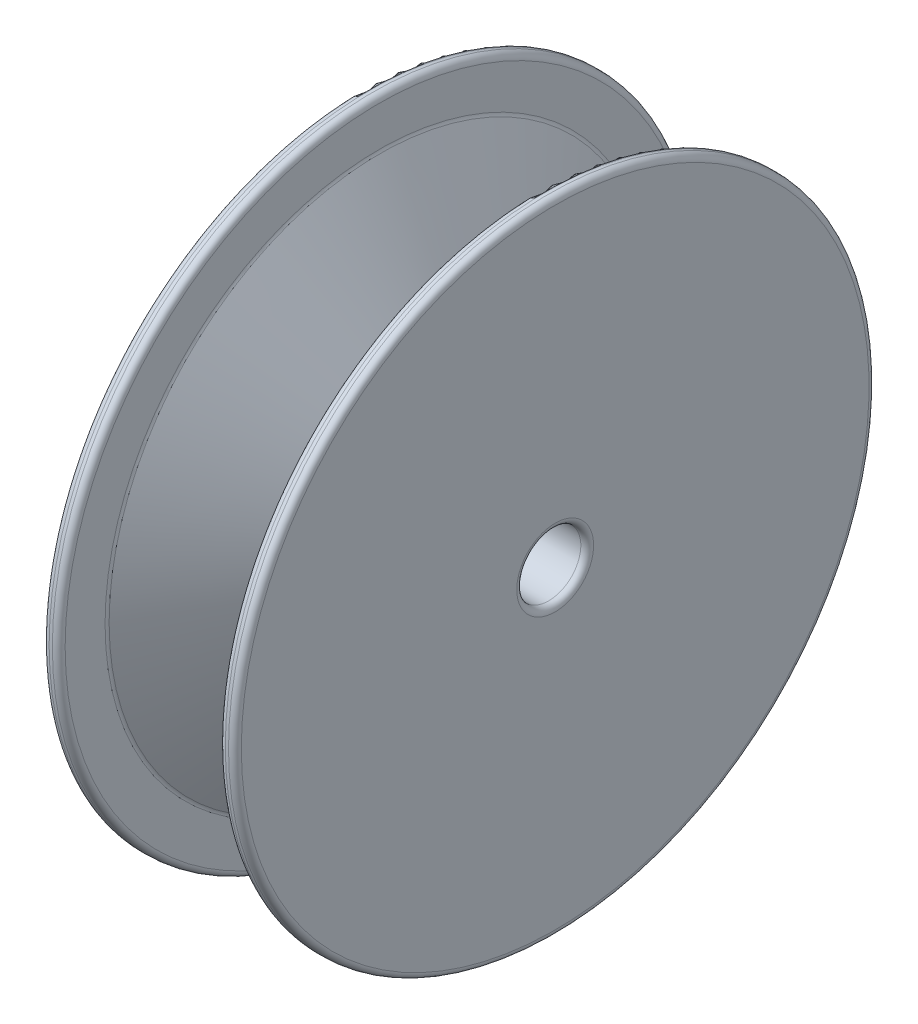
ISO-10303-21;
HEADER;
FILE_DESCRIPTION(('STEP AP214'),'2;1');
FILE_NAME('part.step','',(''),(''),'','','');
FILE_SCHEMA(('AUTOMOTIVE_DESIGN { 1 0 10303 214 1 1 1 1 }'));
ENDSEC;
DATA;
#1=APPLICATION_CONTEXT('core data for automotive mechanical design processes');
#2=APPLICATION_PROTOCOL_DEFINITION('international standard','automotive_design',2000,#1);
#3=PRODUCT_CONTEXT('',#1,'mechanical');
#4=PRODUCT('Part','Part','',(#3));
#5=PRODUCT_RELATED_PRODUCT_CATEGORY('part','',(#4));
#6=PRODUCT_DEFINITION_FORMATION('','',#4);
#7=PRODUCT_DEFINITION_CONTEXT('part definition',#1,'design');
#8=PRODUCT_DEFINITION('design','',#6,#7);
#9=PRODUCT_DEFINITION_SHAPE('','',#8);
#10=(LENGTH_UNIT() NAMED_UNIT(*) SI_UNIT(.MILLI.,.METRE.));
#11=(NAMED_UNIT(*) PLANE_ANGLE_UNIT() SI_UNIT($,.RADIAN.));
#12=(NAMED_UNIT(*) SI_UNIT($,.STERADIAN.) SOLID_ANGLE_UNIT());
#13=UNCERTAINTY_MEASURE_WITH_UNIT(LENGTH_MEASURE(1.E-05),#10,'distance_accuracy_value','');
#14=(GEOMETRIC_REPRESENTATION_CONTEXT(3) GLOBAL_UNCERTAINTY_ASSIGNED_CONTEXT((#13)) GLOBAL_UNIT_ASSIGNED_CONTEXT((#10,
#11,#12)) REPRESENTATION_CONTEXT('',''));
#15=CARTESIAN_POINT('',(0.,0.,0.));
#16=DIRECTION('',(0.,0.,1.));
#17=DIRECTION('',(1.,0.,0.));
#18=AXIS2_PLACEMENT_3D('',#15,#16,#17);
#19=CARTESIAN_POINT('',(0.,0.,0.));
#20=DIRECTION('',(-1.,0.,0.));
#21=DIRECTION('',(0.,0.,1.));
#22=AXIS2_PLACEMENT_3D('',#19,#20,#21);
#23=CYLINDRICAL_SURFACE('',#22,1.);
#24=CARTESIAN_POINT('',(2.8,0.,0.));
#25=DIRECTION('',(-1.,0.,0.));
#26=DIRECTION('',(0.,0.,1.));
#27=AXIS2_PLACEMENT_3D('',#24,#25,#26);
#28=CIRCLE('',#27,1.);
#29=CARTESIAN_POINT('',(2.8,0.,1.));
#30=VERTEX_POINT('',#29);
#31=EDGE_CURVE('E40',#30,#30,#28,.F.);
#32=ORIENTED_EDGE('',*,*,#31,.T.);
#33=EDGE_LOOP('',(#32));
#34=FACE_BOUND('',#33,.T.);
#35=CARTESIAN_POINT('',(-2.8,0.,0.));
#36=DIRECTION('',(1.,0.,0.));
#37=DIRECTION('',(0.,0.,-1.));
#38=AXIS2_PLACEMENT_3D('',#35,#36,#37);
#39=CIRCLE('',#38,1.);
#40=CARTESIAN_POINT('',(-2.8,0.,-1.));
#41=VERTEX_POINT('',#40);
#42=EDGE_CURVE('E44',#41,#41,#39,.F.);
#43=ORIENTED_EDGE('',*,*,#42,.T.);
#44=EDGE_LOOP('',(#43));
#45=FACE_BOUND('',#44,.T.);
#46=ADVANCED_FACE('F29',(#34,#45),#23,.F.);
#47=CARTESIAN_POINT('',(3.,1.,0.));
#48=DIRECTION('',(-1.,0.,0.));
#49=DIRECTION('',(0.,0.,1.));
#50=AXIS2_PLACEMENT_3D('',#47,#48,#49);
#51=PLANE('',#50);
#52=CARTESIAN_POINT('',(3.,0.,0.));
#53=DIRECTION('',(-1.,0.,0.));
#54=DIRECTION('',(0.,0.,1.));
#55=AXIS2_PLACEMENT_3D('',#52,#53,#54);
#56=CIRCLE('',#55,1.2);
#57=CARTESIAN_POINT('',(3.,0.,1.2));
#58=VERTEX_POINT('',#57);
#59=EDGE_CURVE('E49',#58,#58,#56,.T.);
#60=ORIENTED_EDGE('',*,*,#59,.T.);
#61=EDGE_LOOP('',(#60));
#62=FACE_BOUND('',#61,.T.);
#63=CARTESIAN_POINT('',(3.,0.,0.));
#64=DIRECTION('',(-1.,0.,0.));
#65=DIRECTION('',(0.,0.,1.));
#66=AXIS2_PLACEMENT_3D('',#63,#64,#65);
#67=CIRCLE('',#66,9.8);
#68=CARTESIAN_POINT('',(3.,0.,9.8));
#69=VERTEX_POINT('',#68);
#70=EDGE_CURVE('E52',#69,#69,#67,.F.);
#71=ORIENTED_EDGE('',*,*,#70,.T.);
#72=EDGE_LOOP('',(#71));
#73=FACE_BOUND('',#72,.T.);
#74=ADVANCED_FACE('F135',(#62,#73),#51,.F.);
#75=CARTESIAN_POINT('',(0.,0.,0.));
#76=DIRECTION('',(-1.,0.,0.));
#77=DIRECTION('',(0.,0.,1.));
#78=AXIS2_PLACEMENT_3D('',#75,#76,#77);
#79=CYLINDRICAL_SURFACE('',#78,10.);
#80=CARTESIAN_POINT('',(2.69999999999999,0.,0.));
#81=DIRECTION('',(1.,0.,0.));
#82=DIRECTION('',(0.,0.,-1.));
#83=AXIS2_PLACEMENT_3D('',#80,#81,#82);
#84=CIRCLE('',#83,10.);
#85=CARTESIAN_POINT('',(2.69999999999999,0.,-10.));
#86=VERTEX_POINT('',#85);
#87=EDGE_CURVE('E79',#86,#86,#84,.T.);
#88=ORIENTED_EDGE('',*,*,#87,.T.);
#89=EDGE_LOOP('',(#88));
#90=FACE_BOUND('',#89,.T.);
#91=CARTESIAN_POINT('',(2.8,0.,0.));
#92=DIRECTION('',(-1.,0.,0.));
#93=DIRECTION('',(0.,0.,1.));
#94=AXIS2_PLACEMENT_3D('',#91,#92,#93);
#95=CIRCLE('',#94,10.);
#96=CARTESIAN_POINT('',(2.8,0.,10.));
#97=VERTEX_POINT('',#96);
#98=EDGE_CURVE('E82',#97,#97,#95,.T.);
#99=ORIENTED_EDGE('',*,*,#98,.T.);
#100=EDGE_LOOP('',(#99));
#101=FACE_BOUND('',#100,.T.);
#102=ADVANCED_FACE('F141',(#90,#101),#79,.T.);
#103=CARTESIAN_POINT('',(2.49999999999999,8.5,0.));
#104=DIRECTION('',(1.,0.,0.));
#105=DIRECTION('',(0.,0.,-1.));
#106=AXIS2_PLACEMENT_3D('',#103,#104,#105);
#107=PLANE('',#106);
#108=CARTESIAN_POINT('',(2.49999999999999,0.,0.));
#109=DIRECTION('',(1.,0.,0.));
#110=DIRECTION('',(0.,0.,-1.));
#111=AXIS2_PLACEMENT_3D('',#108,#109,#110);
#112=CIRCLE('',#111,9.8);
#113=CARTESIAN_POINT('',(2.49999999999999,0.,-9.8));
#114=VERTEX_POINT('',#113);
#115=EDGE_CURVE('E85',#114,#114,#112,.F.);
#116=ORIENTED_EDGE('',*,*,#115,.T.);
#117=EDGE_LOOP('',(#116));
#118=FACE_BOUND('',#117,.T.);
#119=CARTESIAN_POINT('',(2.49999999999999,0.,0.));
#120=DIRECTION('',(1.,0.,0.));
#121=DIRECTION('',(0.,0.,-1.));
#122=AXIS2_PLACEMENT_3D('',#119,#120,#121);
#123=CIRCLE('',#122,8.5535898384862);
#124=CARTESIAN_POINT('',(2.49999999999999,0.,-8.5535898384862));
#125=VERTEX_POINT('',#124);
#126=EDGE_CURVE('E88',#125,#125,#123,.T.);
#127=ORIENTED_EDGE('',*,*,#126,.T.);
#128=EDGE_LOOP('',(#127));
#129=FACE_BOUND('',#128,.T.);
#130=ADVANCED_FACE('F197',(#118,#129),#107,.F.);
#131=CARTESIAN_POINT('',(2.5,0.,0.));
#132=DIRECTION('',(1.,0.,0.));
#133=DIRECTION('',(0.,0.,-1.));
#134=AXIS2_PLACEMENT_3D('',#131,#132,#133);
#135=CONICAL_SURFACE('',#134,8.5,1.04719755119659);
#136=CARTESIAN_POINT('',(2.47320508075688,0.,0.));
#137=DIRECTION('',(1.,0.,0.));
#138=DIRECTION('',(0.,0.,-1.));
#139=AXIS2_PLACEMENT_3D('',#136,#137,#138);
#140=CIRCLE('',#139,8.4535898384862);
#141=CARTESIAN_POINT('',(2.47320508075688,0.,-8.4535898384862));
#142=VERTEX_POINT('',#141);
#143=EDGE_CURVE('E73',#142,#142,#140,.F.);
#144=ORIENTED_EDGE('',*,*,#143,.T.);
#145=EDGE_LOOP('',(#144));
#146=FACE_BOUND('',#145,.T.);
#147=CARTESIAN_POINT('',(0.173205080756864,0.,0.));
#148=DIRECTION('',(1.,0.,0.));
#149=DIRECTION('',(0.,0.,-1.));
#150=AXIS2_PLACEMENT_3D('',#147,#148,#149);
#151=CIRCLE('',#150,4.46987298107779);
#152=CARTESIAN_POINT('',(0.173205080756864,0.,-4.46987298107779));
#153=VERTEX_POINT('',#152);
#154=EDGE_CURVE('E76',#153,#153,#151,.T.);
#155=ORIENTED_EDGE('',*,*,#154,.T.);
#156=EDGE_LOOP('',(#155));
#157=FACE_BOUND('',#156,.T.);
#158=ADVANCED_FACE('F193',(#146,#157),#135,.T.);
#159=CARTESIAN_POINT('',(0.,0.,0.));
#160=DIRECTION('',(-1.,0.,0.));
#161=DIRECTION('',(0.,0.,1.));
#162=AXIS2_PLACEMENT_3D('',#159,#160,#161);
#163=CONICAL_SURFACE('',#162,4.16987298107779,1.0471975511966);
#164=CARTESIAN_POINT('',(-0.173205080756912,0.,0.));
#165=DIRECTION('',(-1.,0.,0.));
#166=DIRECTION('',(0.,0.,1.));
#167=AXIS2_PLACEMENT_3D('',#164,#165,#166);
#168=CIRCLE('',#167,4.46987298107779);
#169=CARTESIAN_POINT('',(-0.173205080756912,0.,4.46987298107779));
#170=VERTEX_POINT('',#169);
#171=EDGE_CURVE('E67',#170,#170,#168,.T.);
#172=ORIENTED_EDGE('',*,*,#171,.T.);
#173=EDGE_LOOP('',(#172));
#174=FACE_BOUND('',#173,.T.);
#175=CARTESIAN_POINT('',(-2.47320508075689,0.,0.));
#176=DIRECTION('',(-1.,0.,0.));
#177=DIRECTION('',(0.,0.,1.));
#178=AXIS2_PLACEMENT_3D('',#175,#176,#177);
#179=CIRCLE('',#178,8.45358983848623);
#180=CARTESIAN_POINT('',(-2.47320508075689,0.,8.45358983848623));
#181=VERTEX_POINT('',#180);
#182=EDGE_CURVE('E70',#181,#181,#179,.F.);
#183=ORIENTED_EDGE('',*,*,#182,.T.);
#184=EDGE_LOOP('',(#183));
#185=FACE_BOUND('',#184,.T.);
#186=ADVANCED_FACE('F187',(#174,#185),#163,.T.);
#187=CARTESIAN_POINT('',(-2.5,10.,0.));
#188=DIRECTION('',(-1.,0.,0.));
#189=DIRECTION('',(0.,0.,1.));
#190=AXIS2_PLACEMENT_3D('',#187,#188,#189);
#191=PLANE('',#190);
#192=CARTESIAN_POINT('',(-2.5,0.,0.));
#193=DIRECTION('',(-1.,0.,0.));
#194=DIRECTION('',(0.,0.,1.));
#195=AXIS2_PLACEMENT_3D('',#192,#193,#194);
#196=CIRCLE('',#195,8.55358983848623);
#197=CARTESIAN_POINT('',(-2.5,0.,8.55358983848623));
#198=VERTEX_POINT('',#197);
#199=EDGE_CURVE('E61',#198,#198,#196,.T.);
#200=ORIENTED_EDGE('',*,*,#199,.T.);
#201=EDGE_LOOP('',(#200));
#202=FACE_BOUND('',#201,.T.);
#203=CARTESIAN_POINT('',(-2.5,0.,0.));
#204=DIRECTION('',(-1.,0.,0.));
#205=DIRECTION('',(0.,0.,1.));
#206=AXIS2_PLACEMENT_3D('',#203,#204,#205);
#207=CIRCLE('',#206,9.8);
#208=CARTESIAN_POINT('',(-2.5,0.,9.8));
#209=VERTEX_POINT('',#208);
#210=EDGE_CURVE('E64',#209,#209,#207,.F.);
#211=ORIENTED_EDGE('',*,*,#210,.T.);
#212=EDGE_LOOP('',(#211));
#213=FACE_BOUND('',#212,.T.);
#214=ADVANCED_FACE('F181',(#202,#213),#191,.F.);
#215=CARTESIAN_POINT('',(0.,0.,0.));
#216=DIRECTION('',(-1.,0.,0.));
#217=DIRECTION('',(0.,0.,1.));
#218=AXIS2_PLACEMENT_3D('',#215,#216,#217);
#219=CYLINDRICAL_SURFACE('',#218,10.);
#220=CARTESIAN_POINT('',(-2.7,0.,0.));
#221=DIRECTION('',(-1.,0.,0.));
#222=DIRECTION('',(0.,0.,1.));
#223=AXIS2_PLACEMENT_3D('',#220,#221,#222);
#224=CIRCLE('',#223,10.);
#225=CARTESIAN_POINT('',(-2.7,0.,10.));
#226=VERTEX_POINT('',#225);
#227=EDGE_CURVE('E55',#226,#226,#224,.T.);
#228=ORIENTED_EDGE('',*,*,#227,.T.);
#229=EDGE_LOOP('',(#228));
#230=FACE_BOUND('',#229,.T.);
#231=CARTESIAN_POINT('',(-2.8,0.,0.));
#232=DIRECTION('',(1.,0.,0.));
#233=DIRECTION('',(0.,0.,-1.));
#234=AXIS2_PLACEMENT_3D('',#231,#232,#233);
#235=CIRCLE('',#234,10.);
#236=CARTESIAN_POINT('',(-2.8,0.,-10.));
#237=VERTEX_POINT('',#236);
#238=EDGE_CURVE('E58',#237,#237,#235,.T.);
#239=ORIENTED_EDGE('',*,*,#238,.T.);
#240=EDGE_LOOP('',(#239));
#241=FACE_BOUND('',#240,.T.);
#242=ADVANCED_FACE('F117',(#230,#241),#219,.T.);
#243=CARTESIAN_POINT('',(-3.,1.,0.));
#244=DIRECTION('',(1.,0.,0.));
#245=DIRECTION('',(0.,0.,-1.));
#246=AXIS2_PLACEMENT_3D('',#243,#244,#245);
#247=PLANE('',#246);
#248=CARTESIAN_POINT('',(-3.,-6.53003817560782,0.));
#249=DIRECTION('',(-1.,0.,0.));
#250=DIRECTION('',(0.,0.,-1.));
#251=AXIS2_PLACEMENT_3D('',#248,#249,#250);
#252=CIRCLE('',#251,0.843426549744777);
#253=CARTESIAN_POINT('',(-3.,-6.53003817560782,-0.843426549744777));
#254=VERTEX_POINT('',#253);
#255=EDGE_CURVE('E98',#254,#254,#252,.T.);
#256=ORIENTED_EDGE('',*,*,#255,.F.);
#257=EDGE_LOOP('',(#256));
#258=FACE_BOUND('',#257,.T.);
#259=CARTESIAN_POINT('',(-3.,6.53003817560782,0.));
#260=DIRECTION('',(-1.,0.,0.));
#261=DIRECTION('',(0.,0.,1.));
#262=AXIS2_PLACEMENT_3D('',#259,#260,#261);
#263=CIRCLE('',#262,0.843426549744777);
#264=CARTESIAN_POINT('',(-3.,6.53003817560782,0.843426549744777));
#265=VERTEX_POINT('',#264);
#266=EDGE_CURVE('E92',#265,#265,#263,.T.);
#267=ORIENTED_EDGE('',*,*,#266,.F.);
#268=EDGE_LOOP('',(#267));
#269=FACE_BOUND('',#268,.T.);
#270=CARTESIAN_POINT('',(-3.,0.,0.));
#271=DIRECTION('',(1.,0.,0.));
#272=DIRECTION('',(0.,0.,-1.));
#273=AXIS2_PLACEMENT_3D('',#270,#271,#272);
#274=CIRCLE('',#273,9.8);
#275=CARTESIAN_POINT('',(-3.,0.,-9.8));
#276=VERTEX_POINT('',#275);
#277=EDGE_CURVE('E10',#276,#276,#274,.F.);
#278=ORIENTED_EDGE('',*,*,#277,.T.);
#279=EDGE_LOOP('',(#278));
#280=FACE_BOUND('',#279,.T.);
#281=CARTESIAN_POINT('',(-3.,0.,0.));
#282=DIRECTION('',(1.,0.,0.));
#283=DIRECTION('',(0.,0.,-1.));
#284=AXIS2_PLACEMENT_3D('',#281,#282,#283);
#285=CIRCLE('',#284,1.2);
#286=CARTESIAN_POINT('',(-3.,0.,-1.2));
#287=VERTEX_POINT('',#286);
#288=EDGE_CURVE('E36',#287,#287,#285,.T.);
#289=ORIENTED_EDGE('',*,*,#288,.T.);
#290=EDGE_LOOP('',(#289));
#291=FACE_BOUND('',#290,.T.);
#292=ADVANCED_FACE('F113',(#258,#269,#280,#291),#247,.F.);
#293=CARTESIAN_POINT('',(2.69999999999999,0.,0.));
#294=DIRECTION('',(1.,0.,0.));
#295=DIRECTION('',(0.,0.,-1.));
#296=AXIS2_PLACEMENT_3D('',#293,#294,#295);
#297=TOROIDAL_SURFACE('',#296,9.8,0.2);
#298=ORIENTED_EDGE('',*,*,#87,.F.);
#299=EDGE_LOOP('',(#298));
#300=FACE_BOUND('',#299,.T.);
#301=ORIENTED_EDGE('',*,*,#115,.F.);
#302=EDGE_LOOP('',(#301));
#303=FACE_BOUND('',#302,.T.);
#304=ADVANCED_FACE('F116',(#300,#303),#297,.T.);
#305=CARTESIAN_POINT('',(2.29999999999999,0.,0.));
#306=DIRECTION('',(1.,0.,0.));
#307=DIRECTION('',(0.,0.,-1.));
#308=AXIS2_PLACEMENT_3D('',#305,#306,#307);
#309=TOROIDAL_SURFACE('',#308,8.5535898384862,0.2);
#310=ORIENTED_EDGE('',*,*,#126,.F.);
#311=EDGE_LOOP('',(#310));
#312=FACE_BOUND('',#311,.T.);
#313=ORIENTED_EDGE('',*,*,#143,.F.);
#314=EDGE_LOOP('',(#313));
#315=FACE_BOUND('',#314,.T.);
#316=ADVANCED_FACE('F149',(#312,#315),#309,.F.);
#317=CARTESIAN_POINT('',(0.,0.,0.));
#318=DIRECTION('',(-1.,0.,0.));
#319=DIRECTION('',(0.,0.,1.));
#320=AXIS2_PLACEMENT_3D('',#317,#318,#319);
#321=TOROIDAL_SURFACE('',#320,4.56987298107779,0.2);
#322=ORIENTED_EDGE('',*,*,#154,.F.);
#323=EDGE_LOOP('',(#322));
#324=FACE_BOUND('',#323,.T.);
#325=ORIENTED_EDGE('',*,*,#171,.F.);
#326=EDGE_LOOP('',(#325));
#327=FACE_BOUND('',#326,.T.);
#328=ADVANCED_FACE('F153',(#324,#327),#321,.F.);
#329=CARTESIAN_POINT('',(-2.3,0.,0.));
#330=DIRECTION('',(-1.,0.,0.));
#331=DIRECTION('',(0.,0.,1.));
#332=AXIS2_PLACEMENT_3D('',#329,#330,#331);
#333=TOROIDAL_SURFACE('',#332,8.55358983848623,0.2);
#334=ORIENTED_EDGE('',*,*,#182,.F.);
#335=EDGE_LOOP('',(#334));
#336=FACE_BOUND('',#335,.T.);
#337=ORIENTED_EDGE('',*,*,#199,.F.);
#338=EDGE_LOOP('',(#337));
#339=FACE_BOUND('',#338,.T.);
#340=ADVANCED_FACE('F157',(#336,#339),#333,.F.);
#341=CARTESIAN_POINT('',(-2.7,0.,0.));
#342=DIRECTION('',(-1.,0.,0.));
#343=DIRECTION('',(0.,0.,1.));
#344=AXIS2_PLACEMENT_3D('',#341,#342,#343);
#345=TOROIDAL_SURFACE('',#344,9.8,0.2);
#346=ORIENTED_EDGE('',*,*,#210,.F.);
#347=EDGE_LOOP('',(#346));
#348=FACE_BOUND('',#347,.T.);
#349=ORIENTED_EDGE('',*,*,#227,.F.);
#350=EDGE_LOOP('',(#349));
#351=FACE_BOUND('',#350,.T.);
#352=ADVANCED_FACE('F161',(#348,#351),#345,.T.);
#353=CARTESIAN_POINT('',(2.8,0.,0.));
#354=DIRECTION('',(-1.,0.,0.));
#355=DIRECTION('',(0.,0.,1.));
#356=AXIS2_PLACEMENT_3D('',#353,#354,#355);
#357=TOROIDAL_SURFACE('',#356,1.2,0.2);
#358=ORIENTED_EDGE('',*,*,#31,.F.);
#359=EDGE_LOOP('',(#358));
#360=FACE_BOUND('',#359,.T.);
#361=ORIENTED_EDGE('',*,*,#59,.F.);
#362=EDGE_LOOP('',(#361));
#363=FACE_BOUND('',#362,.T.);
#364=ADVANCED_FACE('F165',(#360,#363),#357,.T.);
#365=CARTESIAN_POINT('',(2.8,0.,0.));
#366=DIRECTION('',(-1.,0.,0.));
#367=DIRECTION('',(0.,0.,1.));
#368=AXIS2_PLACEMENT_3D('',#365,#366,#367);
#369=TOROIDAL_SURFACE('',#368,9.8,0.2);
#370=ORIENTED_EDGE('',*,*,#70,.F.);
#371=EDGE_LOOP('',(#370));
#372=FACE_BOUND('',#371,.T.);
#373=ORIENTED_EDGE('',*,*,#98,.F.);
#374=EDGE_LOOP('',(#373));
#375=FACE_BOUND('',#374,.T.);
#376=ADVANCED_FACE('F169',(#372,#375),#369,.T.);
#377=CARTESIAN_POINT('',(-2.8,0.,0.));
#378=DIRECTION('',(1.,0.,0.));
#379=DIRECTION('',(0.,0.,-1.));
#380=AXIS2_PLACEMENT_3D('',#377,#378,#379);
#381=TOROIDAL_SURFACE('',#380,9.8,0.2);
#382=ORIENTED_EDGE('',*,*,#238,.F.);
#383=EDGE_LOOP('',(#382));
#384=FACE_BOUND('',#383,.T.);
#385=ORIENTED_EDGE('',*,*,#277,.F.);
#386=EDGE_LOOP('',(#385));
#387=FACE_BOUND('',#386,.T.);
#388=ADVANCED_FACE('F131',(#384,#387),#381,.T.);
#389=CARTESIAN_POINT('',(-2.8,0.,0.));
#390=DIRECTION('',(1.,0.,0.));
#391=DIRECTION('',(0.,0.,-1.));
#392=AXIS2_PLACEMENT_3D('',#389,#390,#391);
#393=TOROIDAL_SURFACE('',#392,1.2,0.2);
#394=ORIENTED_EDGE('',*,*,#288,.F.);
#395=EDGE_LOOP('',(#394));
#396=FACE_BOUND('',#395,.T.);
#397=ORIENTED_EDGE('',*,*,#42,.F.);
#398=EDGE_LOOP('',(#397));
#399=FACE_BOUND('',#398,.T.);
#400=ADVANCED_FACE('F31',(#396,#399),#393,.T.);
#401=CARTESIAN_POINT('',(-2.75,6.53003817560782,0.));
#402=DIRECTION('',(-1.,0.,0.));
#403=DIRECTION('',(0.,0.,1.));
#404=AXIS2_PLACEMENT_3D('',#401,#402,#403);
#405=CYLINDRICAL_SURFACE('',#404,0.843426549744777);
#406=CARTESIAN_POINT('',(-2.75,6.53003817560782,0.));
#407=DIRECTION('',(-1.,0.,0.));
#408=DIRECTION('',(0.,0.,1.));
#409=AXIS2_PLACEMENT_3D('',#406,#407,#408);
#410=CIRCLE('',#409,0.843426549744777);
#411=CARTESIAN_POINT('',(-2.75,6.53003817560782,0.843426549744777));
#412=VERTEX_POINT('',#411);
#413=EDGE_CURVE('E91',#412,#412,#410,.T.);
#414=ORIENTED_EDGE('',*,*,#413,.F.);
#415=EDGE_LOOP('',(#414));
#416=FACE_BOUND('',#415,.T.);
#417=ORIENTED_EDGE('',*,*,#266,.T.);
#418=EDGE_LOOP('',(#417));
#419=FACE_BOUND('',#418,.T.);
#420=ADVANCED_FACE('F121',(#416,#419),#405,.F.);
#421=CARTESIAN_POINT('',(-2.75,6.53003817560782,0.));
#422=DIRECTION('',(-1.,0.,0.));
#423=DIRECTION('',(0.,0.,1.));
#424=AXIS2_PLACEMENT_3D('',#421,#422,#423);
#425=PLANE('',#424);
#426=ORIENTED_EDGE('',*,*,#413,.T.);
#427=EDGE_LOOP('',(#426));
#428=FACE_BOUND('',#427,.T.);
#429=ADVANCED_FACE('F109',(#428),#425,.T.);
#430=CARTESIAN_POINT('',(-2.75,-6.53003817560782,0.));
#431=DIRECTION('',(-1.,0.,0.));
#432=DIRECTION('',(0.,0.,1.));
#433=AXIS2_PLACEMENT_3D('',#430,#431,#432);
#434=CYLINDRICAL_SURFACE('',#433,0.843426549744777);
#435=CARTESIAN_POINT('',(-2.75,-6.53003817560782,0.));
#436=DIRECTION('',(-1.,0.,0.));
#437=DIRECTION('',(0.,0.,-1.));
#438=AXIS2_PLACEMENT_3D('',#435,#436,#437);
#439=CIRCLE('',#438,0.843426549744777);
#440=CARTESIAN_POINT('',(-2.75,-6.53003817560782,-0.843426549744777));
#441=VERTEX_POINT('',#440);
#442=EDGE_CURVE('E95',#441,#441,#439,.T.);
#443=ORIENTED_EDGE('',*,*,#442,.F.);
#444=EDGE_LOOP('',(#443));
#445=FACE_BOUND('',#444,.T.);
#446=ORIENTED_EDGE('',*,*,#255,.T.);
#447=EDGE_LOOP('',(#446));
#448=FACE_BOUND('',#447,.T.);
#449=ADVANCED_FACE('F106',(#445,#448),#434,.F.);
#450=CARTESIAN_POINT('',(-2.75,-6.53003817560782,0.));
#451=DIRECTION('',(1.,0.,0.));
#452=DIRECTION('',(0.,0.,-1.));
#453=AXIS2_PLACEMENT_3D('',#450,#451,#452);
#454=PLANE('',#453);
#455=ORIENTED_EDGE('',*,*,#442,.T.);
#456=EDGE_LOOP('',(#455));
#457=FACE_BOUND('',#456,.T.);
#458=ADVANCED_FACE('F104',(#457),#454,.F.);
#459=CLOSED_SHELL('',(#46,#74,#102,#130,#158,#186,#214,#242,#292,#304,#316,#328,#340,#352,#364,
#376,#388,#400,#420,#429,#449,#458));
#460=MANIFOLD_SOLID_BREP('B2',#459);
#461=ADVANCED_BREP_SHAPE_REPRESENTATION('',(#18,#460),#14);
#462=SHAPE_DEFINITION_REPRESENTATION(#9,#461);
ENDSEC;
END-ISO-10303-21;
